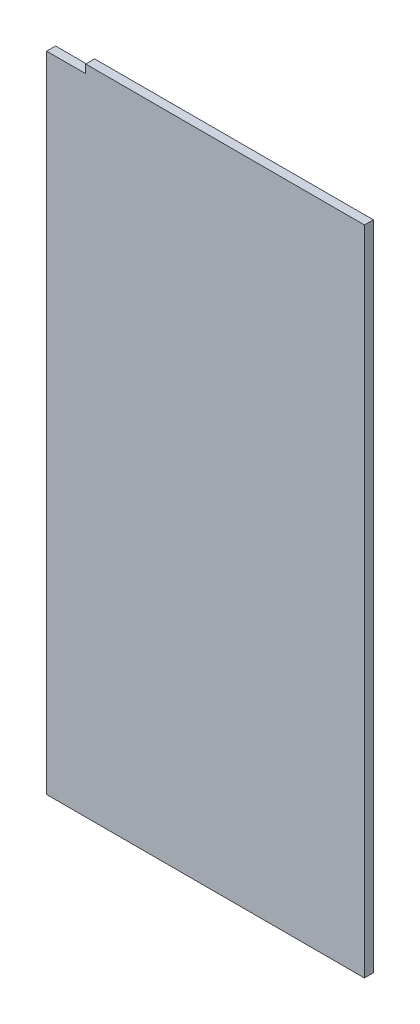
ISO-10303-21;
HEADER;
FILE_DESCRIPTION(('STEP AP214'),'2;1');
FILE_NAME('part.step','',(''),(''),'','','');
FILE_SCHEMA(('AUTOMOTIVE_DESIGN { 1 0 10303 214 1 1 1 1 }'));
ENDSEC;
DATA;
#1=APPLICATION_CONTEXT('core data for automotive mechanical design processes');
#2=APPLICATION_PROTOCOL_DEFINITION('international standard','automotive_design',2000,#1);
#3=PRODUCT_CONTEXT('',#1,'mechanical');
#4=PRODUCT('Part','Part','',(#3));
#5=PRODUCT_RELATED_PRODUCT_CATEGORY('part','',(#4));
#6=PRODUCT_DEFINITION_FORMATION('','',#4);
#7=PRODUCT_DEFINITION_CONTEXT('part definition',#1,'design');
#8=PRODUCT_DEFINITION('design','',#6,#7);
#9=PRODUCT_DEFINITION_SHAPE('','',#8);
#10=(LENGTH_UNIT() NAMED_UNIT(*) SI_UNIT(.MILLI.,.METRE.));
#11=(NAMED_UNIT(*) PLANE_ANGLE_UNIT() SI_UNIT($,.RADIAN.));
#12=(NAMED_UNIT(*) SI_UNIT($,.STERADIAN.) SOLID_ANGLE_UNIT());
#13=UNCERTAINTY_MEASURE_WITH_UNIT(LENGTH_MEASURE(1.E-05),#10,'distance_accuracy_value','');
#14=(GEOMETRIC_REPRESENTATION_CONTEXT(3) GLOBAL_UNCERTAINTY_ASSIGNED_CONTEXT((#13)) GLOBAL_UNIT_ASSIGNED_CONTEXT((#10,
#11,#12)) REPRESENTATION_CONTEXT('',''));
#15=CARTESIAN_POINT('',(0.,0.,0.));
#16=DIRECTION('',(0.,0.,1.));
#17=DIRECTION('',(1.,0.,0.));
#18=AXIS2_PLACEMENT_3D('',#15,#16,#17);
#19=CARTESIAN_POINT('',(-1.38777878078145E-13,1155.,16.));
#20=DIRECTION('',(1.,0.,0.));
#21=DIRECTION('',(0.,1.,0.));
#22=AXIS2_PLACEMENT_3D('',#19,#20,#21);
#23=PLANE('',#22);
#24=DIRECTION('',(0.,-1.,0.));
#25=VECTOR('',#24,1.);
#26=CARTESIAN_POINT('',(-1.38777878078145E-13,1155.,0.));
#27=LINE('',#26,#25);
#28=CARTESIAN_POINT('',(-1.38777878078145E-13,1155.,0.));
#29=VERTEX_POINT('',#28);
#30=CARTESIAN_POINT('',(0.,0.,0.));
#31=VERTEX_POINT('',#30);
#32=EDGE_CURVE('E118',#29,#31,#27,.T.);
#33=ORIENTED_EDGE('',*,*,#32,.T.);
#34=DIRECTION('',(0.,0.,-1.));
#35=VECTOR('',#34,1.);
#36=CARTESIAN_POINT('',(0.,0.,16.));
#37=LINE('',#36,#35);
#38=CARTESIAN_POINT('',(0.,0.,16.));
#39=VERTEX_POINT('',#38);
#40=EDGE_CURVE('E11',#39,#31,#37,.T.);
#41=ORIENTED_EDGE('',*,*,#40,.F.);
#42=DIRECTION('',(0.,-1.,0.));
#43=VECTOR('',#42,1.);
#44=CARTESIAN_POINT('',(-1.38777878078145E-13,1155.,16.));
#45=LINE('',#44,#43);
#46=CARTESIAN_POINT('',(-1.38777878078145E-13,1155.,16.));
#47=VERTEX_POINT('',#46);
#48=EDGE_CURVE('E128',#47,#39,#45,.T.);
#49=ORIENTED_EDGE('',*,*,#48,.F.);
#50=DIRECTION('',(0.,0.,-1.));
#51=VECTOR('',#50,1.);
#52=CARTESIAN_POINT('',(-1.38777878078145E-13,1155.,16.));
#53=LINE('',#52,#51);
#54=EDGE_CURVE('E114',#47,#29,#53,.T.);
#55=ORIENTED_EDGE('',*,*,#54,.T.);
#56=EDGE_LOOP('',(#33,#41,#49,#55));
#57=FACE_BOUND('',#56,.T.);
#58=ADVANCED_FACE('F34',(#57),#23,.F.);
#59=CARTESIAN_POINT('',(0.,0.,16.));
#60=DIRECTION('',(0.,1.,0.));
#61=DIRECTION('',(0.,0.,1.));
#62=AXIS2_PLACEMENT_3D('',#59,#60,#61);
#63=PLANE('',#62);
#64=DIRECTION('',(1.,0.,0.));
#65=VECTOR('',#64,1.);
#66=CARTESIAN_POINT('',(0.,0.,0.));
#67=LINE('',#66,#65);
#68=CARTESIAN_POINT('',(570.,0.,0.));
#69=VERTEX_POINT('',#68);
#70=EDGE_CURVE('E121',#31,#69,#67,.T.);
#71=ORIENTED_EDGE('',*,*,#70,.T.);
#72=DIRECTION('',(0.,0.,-1.));
#73=VECTOR('',#72,1.);
#74=CARTESIAN_POINT('',(570.,0.,16.));
#75=LINE('',#74,#73);
#76=CARTESIAN_POINT('',(570.,0.,16.));
#77=VERTEX_POINT('',#76);
#78=EDGE_CURVE('E42',#77,#69,#75,.T.);
#79=ORIENTED_EDGE('',*,*,#78,.F.);
#80=DIRECTION('',(1.,0.,0.));
#81=VECTOR('',#80,1.);
#82=CARTESIAN_POINT('',(0.,0.,16.));
#83=LINE('',#82,#81);
#84=EDGE_CURVE('E87',#39,#77,#83,.T.);
#85=ORIENTED_EDGE('',*,*,#84,.F.);
#86=ORIENTED_EDGE('',*,*,#40,.T.);
#87=EDGE_LOOP('',(#71,#79,#85,#86));
#88=FACE_BOUND('',#87,.T.);
#89=ADVANCED_FACE('F152',(#88),#63,.F.);
#90=CARTESIAN_POINT('',(570.,0.,16.));
#91=DIRECTION('',(-1.,0.,0.));
#92=DIRECTION('',(0.,0.,1.));
#93=AXIS2_PLACEMENT_3D('',#90,#91,#92);
#94=PLANE('',#93);
#95=DIRECTION('',(0.,1.,0.));
#96=VECTOR('',#95,1.);
#97=CARTESIAN_POINT('',(570.,0.,0.));
#98=LINE('',#97,#96);
#99=CARTESIAN_POINT('',(570.,1170.,0.));
#100=VERTEX_POINT('',#99);
#101=EDGE_CURVE('E123',#69,#100,#98,.T.);
#102=ORIENTED_EDGE('',*,*,#101,.T.);
#103=DIRECTION('',(0.,0.,-1.));
#104=VECTOR('',#103,1.);
#105=CARTESIAN_POINT('',(570.,1170.,16.));
#106=LINE('',#105,#104);
#107=CARTESIAN_POINT('',(570.,1170.,16.));
#108=VERTEX_POINT('',#107);
#109=EDGE_CURVE('E109',#108,#100,#106,.T.);
#110=ORIENTED_EDGE('',*,*,#109,.F.);
#111=DIRECTION('',(0.,1.,0.));
#112=VECTOR('',#111,1.);
#113=CARTESIAN_POINT('',(570.,0.,16.));
#114=LINE('',#113,#112);
#115=EDGE_CURVE('E100',#77,#108,#114,.T.);
#116=ORIENTED_EDGE('',*,*,#115,.F.);
#117=ORIENTED_EDGE('',*,*,#78,.T.);
#118=EDGE_LOOP('',(#102,#110,#116,#117));
#119=FACE_BOUND('',#118,.T.);
#120=ADVANCED_FACE('F134',(#119),#94,.F.);
#121=CARTESIAN_POINT('',(570.,1170.,16.));
#122=DIRECTION('',(0.,-1.,0.));
#123=DIRECTION('',(0.,0.,-1.));
#124=AXIS2_PLACEMENT_3D('',#121,#122,#123);
#125=PLANE('',#124);
#126=DIRECTION('',(-1.,0.,0.));
#127=VECTOR('',#126,1.);
#128=CARTESIAN_POINT('',(570.,1170.,0.));
#129=LINE('',#128,#127);
#130=CARTESIAN_POINT('',(69.9999999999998,1170.,0.));
#131=VERTEX_POINT('',#130);
#132=EDGE_CURVE('E108',#100,#131,#129,.T.);
#133=ORIENTED_EDGE('',*,*,#132,.T.);
#134=DIRECTION('',(0.,0.,-1.));
#135=VECTOR('',#134,1.);
#136=CARTESIAN_POINT('',(69.9999999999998,1170.,16.));
#137=LINE('',#136,#135);
#138=CARTESIAN_POINT('',(69.9999999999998,1170.,16.));
#139=VERTEX_POINT('',#138);
#140=EDGE_CURVE('E105',#139,#131,#137,.T.);
#141=ORIENTED_EDGE('',*,*,#140,.F.);
#142=DIRECTION('',(-1.,0.,0.));
#143=VECTOR('',#142,1.);
#144=CARTESIAN_POINT('',(570.,1170.,16.));
#145=LINE('',#144,#143);
#146=EDGE_CURVE('E94',#108,#139,#145,.T.);
#147=ORIENTED_EDGE('',*,*,#146,.F.);
#148=ORIENTED_EDGE('',*,*,#109,.T.);
#149=EDGE_LOOP('',(#133,#141,#147,#148));
#150=FACE_BOUND('',#149,.T.);
#151=ADVANCED_FACE('F106',(#150),#125,.F.);
#152=CARTESIAN_POINT('',(69.9999999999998,1170.,16.));
#153=DIRECTION('',(1.,0.,0.));
#154=DIRECTION('',(0.,1.,0.));
#155=AXIS2_PLACEMENT_3D('',#152,#153,#154);
#156=PLANE('',#155);
#157=DIRECTION('',(0.,-1.,0.));
#158=VECTOR('',#157,1.);
#159=CARTESIAN_POINT('',(69.9999999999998,1170.,0.));
#160=LINE('',#159,#158);
#161=CARTESIAN_POINT('',(69.9999999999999,1155.,0.));
#162=VERTEX_POINT('',#161);
#163=EDGE_CURVE('E73',#131,#162,#160,.T.);
#164=ORIENTED_EDGE('',*,*,#163,.T.);
#165=DIRECTION('',(0.,0.,-1.));
#166=VECTOR('',#165,1.);
#167=CARTESIAN_POINT('',(69.9999999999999,1155.,16.));
#168=LINE('',#167,#166);
#169=CARTESIAN_POINT('',(69.9999999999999,1155.,16.));
#170=VERTEX_POINT('',#169);
#171=EDGE_CURVE('E110',#170,#162,#168,.T.);
#172=ORIENTED_EDGE('',*,*,#171,.F.);
#173=DIRECTION('',(0.,-1.,0.));
#174=VECTOR('',#173,1.);
#175=CARTESIAN_POINT('',(69.9999999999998,1170.,16.));
#176=LINE('',#175,#174);
#177=EDGE_CURVE('E98',#139,#170,#176,.T.);
#178=ORIENTED_EDGE('',*,*,#177,.F.);
#179=ORIENTED_EDGE('',*,*,#140,.T.);
#180=EDGE_LOOP('',(#164,#172,#178,#179));
#181=FACE_BOUND('',#180,.T.);
#182=ADVANCED_FACE('F112',(#181),#156,.F.);
#183=CARTESIAN_POINT('',(69.9999999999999,1155.,16.));
#184=DIRECTION('',(0.,-1.,0.));
#185=DIRECTION('',(0.,0.,-1.));
#186=AXIS2_PLACEMENT_3D('',#183,#184,#185);
#187=PLANE('',#186);
#188=DIRECTION('',(-1.,0.,0.));
#189=VECTOR('',#188,1.);
#190=CARTESIAN_POINT('',(69.9999999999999,1155.,0.));
#191=LINE('',#190,#189);
#192=EDGE_CURVE('E79',#162,#29,#191,.T.);
#193=ORIENTED_EDGE('',*,*,#192,.T.);
#194=ORIENTED_EDGE('',*,*,#54,.F.);
#195=DIRECTION('',(-1.,0.,0.));
#196=VECTOR('',#195,1.);
#197=CARTESIAN_POINT('',(69.9999999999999,1155.,16.));
#198=LINE('',#197,#196);
#199=EDGE_CURVE('E50',#170,#47,#198,.T.);
#200=ORIENTED_EDGE('',*,*,#199,.F.);
#201=ORIENTED_EDGE('',*,*,#171,.T.);
#202=EDGE_LOOP('',(#193,#194,#200,#201));
#203=FACE_BOUND('',#202,.T.);
#204=ADVANCED_FACE('F141',(#203),#187,.F.);
#205=CARTESIAN_POINT('',(0.,0.,16.));
#206=DIRECTION('',(0.,0.,1.));
#207=DIRECTION('',(1.,0.,0.));
#208=AXIS2_PLACEMENT_3D('',#205,#206,#207);
#209=PLANE('',#208);
#210=ORIENTED_EDGE('',*,*,#48,.T.);
#211=ORIENTED_EDGE('',*,*,#84,.T.);
#212=ORIENTED_EDGE('',*,*,#115,.T.);
#213=ORIENTED_EDGE('',*,*,#146,.T.);
#214=ORIENTED_EDGE('',*,*,#177,.T.);
#215=ORIENTED_EDGE('',*,*,#199,.T.);
#216=EDGE_LOOP('',(#210,#211,#212,#213,#214,#215));
#217=FACE_BOUND('',#216,.T.);
#218=ADVANCED_FACE('F96',(#217),#209,.T.);
#219=CARTESIAN_POINT('',(0.,0.,0.));
#220=DIRECTION('',(0.,0.,1.));
#221=DIRECTION('',(1.,0.,0.));
#222=AXIS2_PLACEMENT_3D('',#219,#220,#221);
#223=PLANE('',#222);
#224=ORIENTED_EDGE('',*,*,#32,.F.);
#225=ORIENTED_EDGE('',*,*,#192,.F.);
#226=ORIENTED_EDGE('',*,*,#163,.F.);
#227=ORIENTED_EDGE('',*,*,#132,.F.);
#228=ORIENTED_EDGE('',*,*,#101,.F.);
#229=ORIENTED_EDGE('',*,*,#70,.F.);
#230=EDGE_LOOP('',(#224,#225,#226,#227,#228,#229));
#231=FACE_BOUND('',#230,.T.);
#232=ADVANCED_FACE('F137',(#231),#223,.F.);
#233=CLOSED_SHELL('',(#58,#89,#120,#151,#182,#204,#218,#232));
#234=MANIFOLD_SOLID_BREP('B2',#233);
#235=ADVANCED_BREP_SHAPE_REPRESENTATION('',(#18,#234),#14);
#236=SHAPE_DEFINITION_REPRESENTATION(#9,#235);
ENDSEC;
END-ISO-10303-21;
